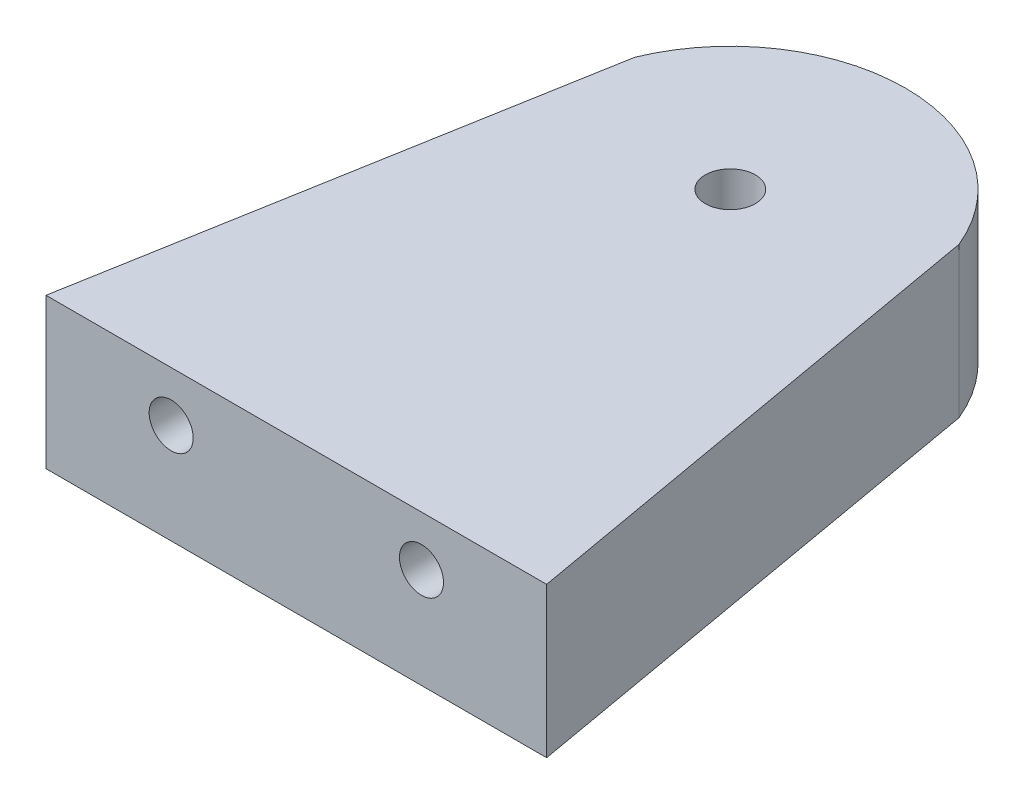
from build123d import *

# Parameters (mm, degrees)
EXTRUIR1_DEPTH                      = 30
TALADRO_ROSCADO_DE_M10X1_25_1_D     = 8.8
TALADRO_ROSCADO_DE_M10X1_25_1_DEPTH = 26.25
TALADRO_ROSCADO_DE_M10X1_25_1_TIP   = 2.643786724
CROQUIS5_R                          = 5
CORTAR_EXTRUIR2_DEPTH               = 40


with BuildPart() as part:
    # Croquis1 → Extruir1 (new body)
    with BuildSketch(Plane(origin=(0, 0, 0), x_dir=(1, 0, 0), z_dir=(0, 1, 0))):
        with BuildLine():
            Line((-50, -50), (50, -50))
            Line((50, -50), (32.367301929, 50))
            ThreePointArc((32.367301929, 50), (0, 71.682426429), (-32.367301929, 50))
            Line((-32.367301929, 50), (-50, -50))
        make_face()
    extrude(amount=EXTRUIR1_DEPTH)

    # Taladro roscado de M10x1.25-1
    with Locations(Plane(origin=(-25, 20, 50), x_dir=(1, 0, 0), z_dir=(0, 0, 1))):
        with Locations((0, 0), (50, 0)):
            Hole(TALADRO_ROSCADO_DE_M10X1_25_1_D / 2, depth=TALADRO_ROSCADO_DE_M10X1_25_1_DEPTH)
            with Locations((0, 0, -(TALADRO_ROSCADO_DE_M10X1_25_1_DEPTH + TALADRO_ROSCADO_DE_M10X1_25_1_TIP / 2))):  # 118° drill point
                Cone(0, TALADRO_ROSCADO_DE_M10X1_25_1_D / 2, TALADRO_ROSCADO_DE_M10X1_25_1_TIP, mode=Mode.SUBTRACT)

    # Croquis5 → Cortar-Extruir2 (cut)
    with BuildSketch(Plane(origin=(0, 30, 0), x_dir=(1, 0, 0), z_dir=(0, 1, 0))):
        with Locations(Location((0, 36.682426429, 0), (0, 0, 270))):
            Circle(CROQUIS5_R)
    extrude(amount=-CORTAR_EXTRUIR2_DEPTH, mode=Mode.SUBTRACT)


solid = part.part
